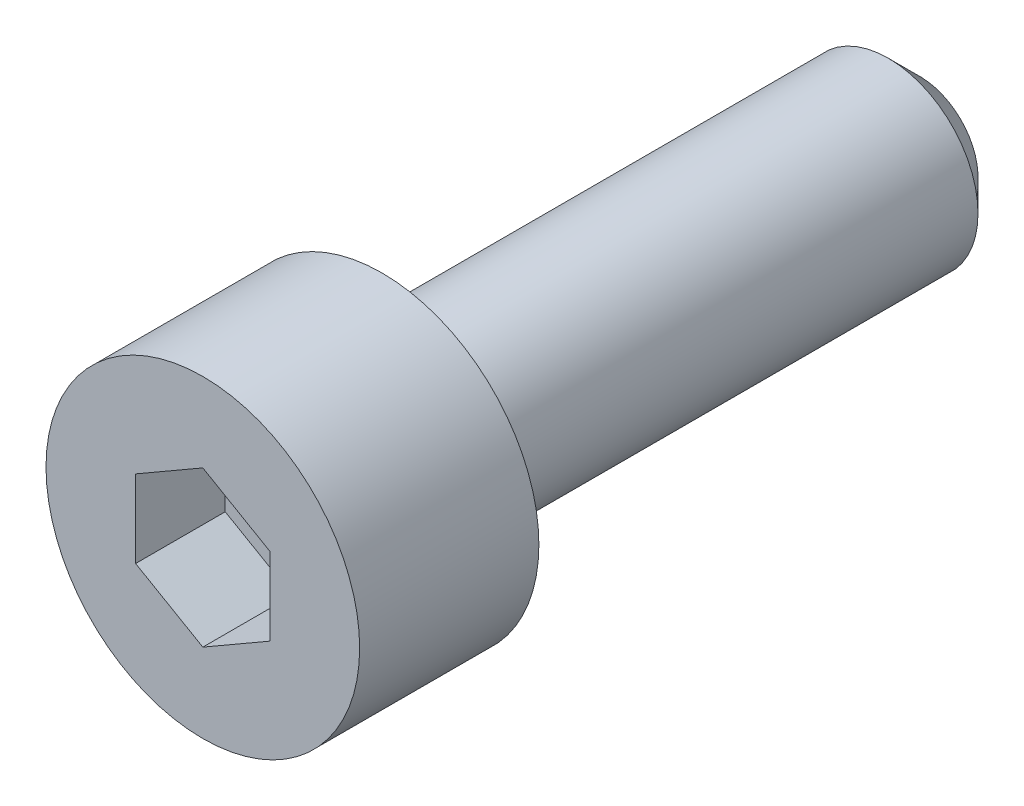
ISO-10303-21;
HEADER;
FILE_DESCRIPTION(('STEP AP214'),'2;1');
FILE_NAME('part.step','',(''),(''),'','','');
FILE_SCHEMA(('AUTOMOTIVE_DESIGN { 1 0 10303 214 1 1 1 1 }'));
ENDSEC;
DATA;
#1=APPLICATION_CONTEXT('core data for automotive mechanical design processes');
#2=APPLICATION_PROTOCOL_DEFINITION('international standard','automotive_design',2000,#1);
#3=PRODUCT_CONTEXT('',#1,'mechanical');
#4=PRODUCT('Part','Part','',(#3));
#5=PRODUCT_RELATED_PRODUCT_CATEGORY('part','',(#4));
#6=PRODUCT_DEFINITION_FORMATION('','',#4);
#7=PRODUCT_DEFINITION_CONTEXT('part definition',#1,'design');
#8=PRODUCT_DEFINITION('design','',#6,#7);
#9=PRODUCT_DEFINITION_SHAPE('','',#8);
#10=(LENGTH_UNIT() NAMED_UNIT(*) SI_UNIT(.MILLI.,.METRE.));
#11=(NAMED_UNIT(*) PLANE_ANGLE_UNIT() SI_UNIT($,.RADIAN.));
#12=(NAMED_UNIT(*) SI_UNIT($,.STERADIAN.) SOLID_ANGLE_UNIT());
#13=UNCERTAINTY_MEASURE_WITH_UNIT(LENGTH_MEASURE(1.E-05),#10,'distance_accuracy_value','');
#14=(GEOMETRIC_REPRESENTATION_CONTEXT(3) GLOBAL_UNCERTAINTY_ASSIGNED_CONTEXT((#13)) GLOBAL_UNIT_ASSIGNED_CONTEXT((#10,
#11,#12)) REPRESENTATION_CONTEXT('',''));
#15=CARTESIAN_POINT('',(0.,0.,0.));
#16=DIRECTION('',(0.,0.,1.));
#17=DIRECTION('',(1.,0.,0.));
#18=AXIS2_PLACEMENT_3D('',#15,#16,#17);
#19=CARTESIAN_POINT('',(0.,1.73205080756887,2.));
#20=DIRECTION('',(-0.5,-0.86602540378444,0.));
#21=DIRECTION('',(0.86602540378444,-0.5,0.));
#22=AXIS2_PLACEMENT_3D('',#19,#20,#21);
#23=PLANE('',#22);
#24=DIRECTION('',(0.,0.,1.));
#25=VECTOR('',#24,1.);
#26=CARTESIAN_POINT('',(1.5,0.866025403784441,2.));
#27=LINE('',#26,#25);
#28=CARTESIAN_POINT('',(1.5,0.866025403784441,2.));
#29=VERTEX_POINT('',#28);
#30=CARTESIAN_POINT('',(1.5,0.866025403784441,4.));
#31=VERTEX_POINT('',#30);
#32=EDGE_CURVE('E63',#29,#31,#27,.T.);
#33=ORIENTED_EDGE('',*,*,#32,.T.);
#34=DIRECTION('',(0.86602540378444,-0.5,0.));
#35=VECTOR('',#34,1.);
#36=CARTESIAN_POINT('',(0.,1.73205080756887,4.));
#37=LINE('',#36,#35);
#38=CARTESIAN_POINT('',(0.,1.73205080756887,4.));
#39=VERTEX_POINT('',#38);
#40=EDGE_CURVE('E29',#39,#31,#37,.T.);
#41=ORIENTED_EDGE('',*,*,#40,.F.);
#42=DIRECTION('',(0.,0.,1.));
#43=VECTOR('',#42,1.);
#44=CARTESIAN_POINT('',(0.,1.73205080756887,2.));
#45=LINE('',#44,#43);
#46=CARTESIAN_POINT('',(0.,1.73205080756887,2.));
#47=VERTEX_POINT('',#46);
#48=EDGE_CURVE('E33',#47,#39,#45,.T.);
#49=ORIENTED_EDGE('',*,*,#48,.F.);
#50=DIRECTION('',(0.86602540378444,-0.5,0.));
#51=VECTOR('',#50,1.);
#52=CARTESIAN_POINT('',(0.,1.73205080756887,2.));
#53=LINE('',#52,#51);
#54=EDGE_CURVE('E65',#47,#29,#53,.T.);
#55=ORIENTED_EDGE('',*,*,#54,.T.);
#56=EDGE_LOOP('',(#33,#41,#49,#55));
#57=FACE_BOUND('',#56,.T.);
#58=ADVANCED_FACE('F14',(#57),#23,.T.);
#59=CARTESIAN_POINT('',(1.5,-0.866025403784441,2.));
#60=DIRECTION('',(1.,0.,0.));
#61=DIRECTION('',(0.,1.,0.));
#62=AXIS2_PLACEMENT_3D('',#59,#60,#61);
#63=PLANE('',#62);
#64=DIRECTION('',(0.,0.,1.));
#65=VECTOR('',#64,1.);
#66=CARTESIAN_POINT('',(1.5,-0.866025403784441,2.));
#67=LINE('',#66,#65);
#68=CARTESIAN_POINT('',(1.5,-0.866025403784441,2.));
#69=VERTEX_POINT('',#68);
#70=CARTESIAN_POINT('',(1.5,-0.866025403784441,4.));
#71=VERTEX_POINT('',#70);
#72=EDGE_CURVE('E70',#69,#71,#67,.T.);
#73=ORIENTED_EDGE('',*,*,#72,.T.);
#74=DIRECTION('',(0.,1.,0.));
#75=VECTOR('',#74,1.);
#76=CARTESIAN_POINT('',(1.5,-0.866025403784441,4.));
#77=LINE('',#76,#75);
#78=EDGE_CURVE('E73',#71,#31,#77,.T.);
#79=ORIENTED_EDGE('',*,*,#78,.T.);
#80=ORIENTED_EDGE('',*,*,#32,.F.);
#81=DIRECTION('',(0.,1.,0.));
#82=VECTOR('',#81,1.);
#83=CARTESIAN_POINT('',(1.5,-0.866025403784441,2.));
#84=LINE('',#83,#82);
#85=EDGE_CURVE('E100',#69,#29,#84,.T.);
#86=ORIENTED_EDGE('',*,*,#85,.F.);
#87=EDGE_LOOP('',(#73,#79,#80,#86));
#88=FACE_BOUND('',#87,.T.);
#89=ADVANCED_FACE('F74',(#88),#63,.F.);
#90=CARTESIAN_POINT('',(0.,-1.73205080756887,2.));
#91=DIRECTION('',(0.5,-0.86602540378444,0.));
#92=DIRECTION('',(0.86602540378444,0.5,0.));
#93=AXIS2_PLACEMENT_3D('',#90,#91,#92);
#94=PLANE('',#93);
#95=DIRECTION('',(0.,0.,1.));
#96=VECTOR('',#95,1.);
#97=CARTESIAN_POINT('',(0.,-1.73205080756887,2.));
#98=LINE('',#97,#96);
#99=CARTESIAN_POINT('',(0.,-1.73205080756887,2.));
#100=VERTEX_POINT('',#99);
#101=CARTESIAN_POINT('',(0.,-1.73205080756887,4.));
#102=VERTEX_POINT('',#101);
#103=EDGE_CURVE('E108',#100,#102,#98,.T.);
#104=ORIENTED_EDGE('',*,*,#103,.T.);
#105=DIRECTION('',(0.86602540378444,0.5,0.));
#106=VECTOR('',#105,1.);
#107=CARTESIAN_POINT('',(0.,-1.73205080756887,4.));
#108=LINE('',#107,#106);
#109=EDGE_CURVE('E78',#102,#71,#108,.T.);
#110=ORIENTED_EDGE('',*,*,#109,.T.);
#111=ORIENTED_EDGE('',*,*,#72,.F.);
#112=DIRECTION('',(0.86602540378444,0.5,0.));
#113=VECTOR('',#112,1.);
#114=CARTESIAN_POINT('',(0.,-1.73205080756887,2.));
#115=LINE('',#114,#113);
#116=EDGE_CURVE('E97',#100,#69,#115,.T.);
#117=ORIENTED_EDGE('',*,*,#116,.F.);
#118=EDGE_LOOP('',(#104,#110,#111,#117));
#119=FACE_BOUND('',#118,.T.);
#120=ADVANCED_FACE('F141',(#119),#94,.F.);
#121=CARTESIAN_POINT('',(0.,-1.73205080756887,2.));
#122=DIRECTION('',(0.5,0.86602540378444,0.));
#123=DIRECTION('',(-0.86602540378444,0.5,0.));
#124=AXIS2_PLACEMENT_3D('',#121,#122,#123);
#125=PLANE('',#124);
#126=DIRECTION('',(0.,0.,1.));
#127=VECTOR('',#126,1.);
#128=CARTESIAN_POINT('',(-1.5,-0.866025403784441,2.));
#129=LINE('',#128,#127);
#130=CARTESIAN_POINT('',(-1.5,-0.866025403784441,2.));
#131=VERTEX_POINT('',#130);
#132=CARTESIAN_POINT('',(-1.5,-0.866025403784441,4.));
#133=VERTEX_POINT('',#132);
#134=EDGE_CURVE('E106',#131,#133,#129,.T.);
#135=ORIENTED_EDGE('',*,*,#134,.T.);
#136=DIRECTION('',(-0.86602540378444,0.5,0.));
#137=VECTOR('',#136,1.);
#138=CARTESIAN_POINT('',(0.,-1.73205080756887,4.));
#139=LINE('',#138,#137);
#140=EDGE_CURVE('E189',#102,#133,#139,.T.);
#141=ORIENTED_EDGE('',*,*,#140,.F.);
#142=ORIENTED_EDGE('',*,*,#103,.F.);
#143=DIRECTION('',(-0.86602540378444,0.5,0.));
#144=VECTOR('',#143,1.);
#145=CARTESIAN_POINT('',(0.,-1.73205080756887,2.));
#146=LINE('',#145,#144);
#147=EDGE_CURVE('E94',#100,#131,#146,.T.);
#148=ORIENTED_EDGE('',*,*,#147,.T.);
#149=EDGE_LOOP('',(#135,#141,#142,#148));
#150=FACE_BOUND('',#149,.T.);
#151=ADVANCED_FACE('F153',(#150),#125,.T.);
#152=CARTESIAN_POINT('',(-1.5,0.866025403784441,2.));
#153=DIRECTION('',(-1.,0.,0.));
#154=DIRECTION('',(0.,-1.,0.));
#155=AXIS2_PLACEMENT_3D('',#152,#153,#154);
#156=PLANE('',#155);
#157=DIRECTION('',(0.,0.,1.));
#158=VECTOR('',#157,1.);
#159=CARTESIAN_POINT('',(-1.5,0.866025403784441,2.));
#160=LINE('',#159,#158);
#161=CARTESIAN_POINT('',(-1.5,0.866025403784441,2.));
#162=VERTEX_POINT('',#161);
#163=CARTESIAN_POINT('',(-1.5,0.866025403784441,4.));
#164=VERTEX_POINT('',#163);
#165=EDGE_CURVE('E104',#162,#164,#160,.T.);
#166=ORIENTED_EDGE('',*,*,#165,.T.);
#167=DIRECTION('',(0.,-1.,0.));
#168=VECTOR('',#167,1.);
#169=CARTESIAN_POINT('',(-1.5,0.866025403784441,4.));
#170=LINE('',#169,#168);
#171=EDGE_CURVE('E190',#164,#133,#170,.T.);
#172=ORIENTED_EDGE('',*,*,#171,.T.);
#173=ORIENTED_EDGE('',*,*,#134,.F.);
#174=DIRECTION('',(0.,-1.,0.));
#175=VECTOR('',#174,1.);
#176=CARTESIAN_POINT('',(-1.5,0.866025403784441,2.));
#177=LINE('',#176,#175);
#178=EDGE_CURVE('E91',#162,#131,#177,.T.);
#179=ORIENTED_EDGE('',*,*,#178,.F.);
#180=EDGE_LOOP('',(#166,#172,#173,#179));
#181=FACE_BOUND('',#180,.T.);
#182=ADVANCED_FACE('F149',(#181),#156,.F.);
#183=CARTESIAN_POINT('',(0.,1.73205080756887,2.));
#184=DIRECTION('',(-0.5,0.86602540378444,0.));
#185=DIRECTION('',(-0.86602540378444,-0.5,0.));
#186=AXIS2_PLACEMENT_3D('',#183,#184,#185);
#187=PLANE('',#186);
#188=DIRECTION('',(-0.86602540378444,-0.5,0.));
#189=VECTOR('',#188,1.);
#190=CARTESIAN_POINT('',(0.,1.73205080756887,2.));
#191=LINE('',#190,#189);
#192=EDGE_CURVE('E88',#47,#162,#191,.T.);
#193=ORIENTED_EDGE('',*,*,#192,.F.);
#194=ORIENTED_EDGE('',*,*,#48,.T.);
#195=DIRECTION('',(-0.86602540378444,-0.5,0.));
#196=VECTOR('',#195,1.);
#197=CARTESIAN_POINT('',(0.,1.73205080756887,4.));
#198=LINE('',#197,#196);
#199=EDGE_CURVE('E84',#39,#164,#198,.T.);
#200=ORIENTED_EDGE('',*,*,#199,.T.);
#201=ORIENTED_EDGE('',*,*,#165,.F.);
#202=EDGE_LOOP('',(#193,#194,#200,#201));
#203=FACE_BOUND('',#202,.T.);
#204=ADVANCED_FACE('F146',(#203),#187,.F.);
#205=CARTESIAN_POINT('',(1.5,0.866025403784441,2.));
#206=DIRECTION('',(0.,0.,1.));
#207=DIRECTION('',(1.,0.,0.));
#208=AXIS2_PLACEMENT_3D('',#205,#206,#207);
#209=PLANE('',#208);
#210=ORIENTED_EDGE('',*,*,#54,.F.);
#211=ORIENTED_EDGE('',*,*,#192,.T.);
#212=ORIENTED_EDGE('',*,*,#178,.T.);
#213=ORIENTED_EDGE('',*,*,#147,.F.);
#214=ORIENTED_EDGE('',*,*,#116,.T.);
#215=ORIENTED_EDGE('',*,*,#85,.T.);
#216=EDGE_LOOP('',(#210,#211,#212,#213,#214,#215));
#217=FACE_BOUND('',#216,.T.);
#218=ADVANCED_FACE('F145',(#217),#209,.T.);
#219=CARTESIAN_POINT('',(0.,0.,4.));
#220=DIRECTION('',(0.,0.,1.));
#221=DIRECTION('',(1.,0.,0.));
#222=AXIS2_PLACEMENT_3D('',#219,#220,#221);
#223=PLANE('',#222);
#224=CARTESIAN_POINT('',(0.,0.,4.));
#225=DIRECTION('',(0.,0.,1.));
#226=DIRECTION('',(1.,0.,0.));
#227=AXIS2_PLACEMENT_3D('',#224,#225,#226);
#228=CIRCLE('',#227,3.5);
#229=CARTESIAN_POINT('',(3.5,0.,4.));
#230=VERTEX_POINT('',#229);
#231=EDGE_CURVE('E116',#230,#230,#228,.T.);
#232=ORIENTED_EDGE('',*,*,#231,.T.);
#233=EDGE_LOOP('',(#232));
#234=FACE_BOUND('',#233,.T.);
#235=ORIENTED_EDGE('',*,*,#199,.F.);
#236=ORIENTED_EDGE('',*,*,#40,.T.);
#237=ORIENTED_EDGE('',*,*,#78,.F.);
#238=ORIENTED_EDGE('',*,*,#109,.F.);
#239=ORIENTED_EDGE('',*,*,#140,.T.);
#240=ORIENTED_EDGE('',*,*,#171,.F.);
#241=EDGE_LOOP('',(#235,#236,#237,#238,#239,#240));
#242=FACE_BOUND('',#241,.T.);
#243=ADVANCED_FACE('F81',(#234,#242),#223,.T.);
#244=CARTESIAN_POINT('',(0.,0.,8.));
#245=DIRECTION('',(0.,0.,1.));
#246=DIRECTION('',(1.,0.,0.));
#247=AXIS2_PLACEMENT_3D('',#244,#245,#246);
#248=CYLINDRICAL_SURFACE('',#247,3.5);
#249=CARTESIAN_POINT('',(0.,0.,0.));
#250=DIRECTION('',(0.,0.,1.));
#251=DIRECTION('',(1.,0.,0.));
#252=AXIS2_PLACEMENT_3D('',#249,#250,#251);
#253=CIRCLE('',#252,3.5);
#254=CARTESIAN_POINT('',(3.5,0.,0.));
#255=VERTEX_POINT('',#254);
#256=EDGE_CURVE('E113',#255,#255,#253,.T.);
#257=ORIENTED_EDGE('',*,*,#256,.T.);
#258=EDGE_LOOP('',(#257));
#259=FACE_BOUND('',#258,.T.);
#260=ORIENTED_EDGE('',*,*,#231,.F.);
#261=EDGE_LOOP('',(#260));
#262=FACE_BOUND('',#261,.T.);
#263=ADVANCED_FACE('F166',(#259,#262),#248,.T.);
#264=CARTESIAN_POINT('',(3.5,0.,0.));
#265=DIRECTION('',(0.,0.,-1.));
#266=DIRECTION('',(-1.,0.,0.));
#267=AXIS2_PLACEMENT_3D('',#264,#265,#266);
#268=PLANE('',#267);
#269=CARTESIAN_POINT('',(0.,0.,0.));
#270=DIRECTION('',(0.,0.,1.));
#271=DIRECTION('',(1.,0.,0.));
#272=AXIS2_PLACEMENT_3D('',#269,#270,#271);
#273=CIRCLE('',#272,2.);
#274=CARTESIAN_POINT('',(2.,0.,0.));
#275=VERTEX_POINT('',#274);
#276=EDGE_CURVE('E69',#275,#275,#273,.T.);
#277=ORIENTED_EDGE('',*,*,#276,.T.);
#278=EDGE_LOOP('',(#277));
#279=FACE_BOUND('',#278,.T.);
#280=ORIENTED_EDGE('',*,*,#256,.F.);
#281=EDGE_LOOP('',(#280));
#282=FACE_BOUND('',#281,.T.);
#283=ADVANCED_FACE('F163',(#279,#282),#268,.T.);
#284=CARTESIAN_POINT('',(0.,0.,8.));
#285=DIRECTION('',(0.,0.,1.));
#286=DIRECTION('',(1.,0.,0.));
#287=AXIS2_PLACEMENT_3D('',#284,#285,#286);
#288=CYLINDRICAL_SURFACE('',#287,2.);
#289=CARTESIAN_POINT('',(0.,0.,-11.3));
#290=DIRECTION('',(0.,0.,-1.));
#291=DIRECTION('',(-1.,0.,0.));
#292=AXIS2_PLACEMENT_3D('',#289,#290,#291);
#293=CIRCLE('',#292,2.);
#294=CARTESIAN_POINT('',(-2.,0.,-11.3));
#295=VERTEX_POINT('',#294);
#296=EDGE_CURVE('E22',#295,#295,#293,.F.);
#297=ORIENTED_EDGE('',*,*,#296,.T.);
#298=EDGE_LOOP('',(#297));
#299=FACE_BOUND('',#298,.T.);
#300=ORIENTED_EDGE('',*,*,#276,.F.);
#301=EDGE_LOOP('',(#300));
#302=FACE_BOUND('',#301,.T.);
#303=ADVANCED_FACE('F121',(#299,#302),#288,.T.);
#304=CARTESIAN_POINT('',(2.,0.,-12.));
#305=DIRECTION('',(0.,0.,-1.));
#306=DIRECTION('',(-1.,0.,0.));
#307=AXIS2_PLACEMENT_3D('',#304,#305,#306);
#308=PLANE('',#307);
#309=CARTESIAN_POINT('',(0.,0.,-12.));
#310=DIRECTION('',(0.,0.,-1.));
#311=DIRECTION('',(-1.,0.,0.));
#312=AXIS2_PLACEMENT_3D('',#309,#310,#311);
#313=CIRCLE('',#312,1.3);
#314=CARTESIAN_POINT('',(-1.3,0.,-12.));
#315=VERTEX_POINT('',#314);
#316=EDGE_CURVE('E9',#315,#315,#313,.T.);
#317=ORIENTED_EDGE('',*,*,#316,.T.);
#318=EDGE_LOOP('',(#317));
#319=FACE_BOUND('',#318,.T.);
#320=ADVANCED_FACE('F125',(#319),#308,.T.);
#321=CARTESIAN_POINT('',(0.,0.,-11.3));
#322=DIRECTION('',(0.,0.,1.));
#323=DIRECTION('',(1.,0.,0.));
#324=AXIS2_PLACEMENT_3D('',#321,#322,#323);
#325=CONICAL_SURFACE('',#324,2.,0.785398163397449);
#326=ORIENTED_EDGE('',*,*,#316,.F.);
#327=EDGE_LOOP('',(#326));
#328=FACE_BOUND('',#327,.T.);
#329=ORIENTED_EDGE('',*,*,#296,.F.);
#330=EDGE_LOOP('',(#329));
#331=FACE_BOUND('',#330,.T.);
#332=ADVANCED_FACE('F16',(#328,#331),#325,.T.);
#333=CLOSED_SHELL('',(#58,#89,#120,#151,#182,#204,#218,#243,#263,#283,#303,#320,#332));
#334=MANIFOLD_SOLID_BREP('B1',#333);
#335=ADVANCED_BREP_SHAPE_REPRESENTATION('',(#18,#334),#14);
#336=SHAPE_DEFINITION_REPRESENTATION(#9,#335);
ENDSEC;
END-ISO-10303-21;
